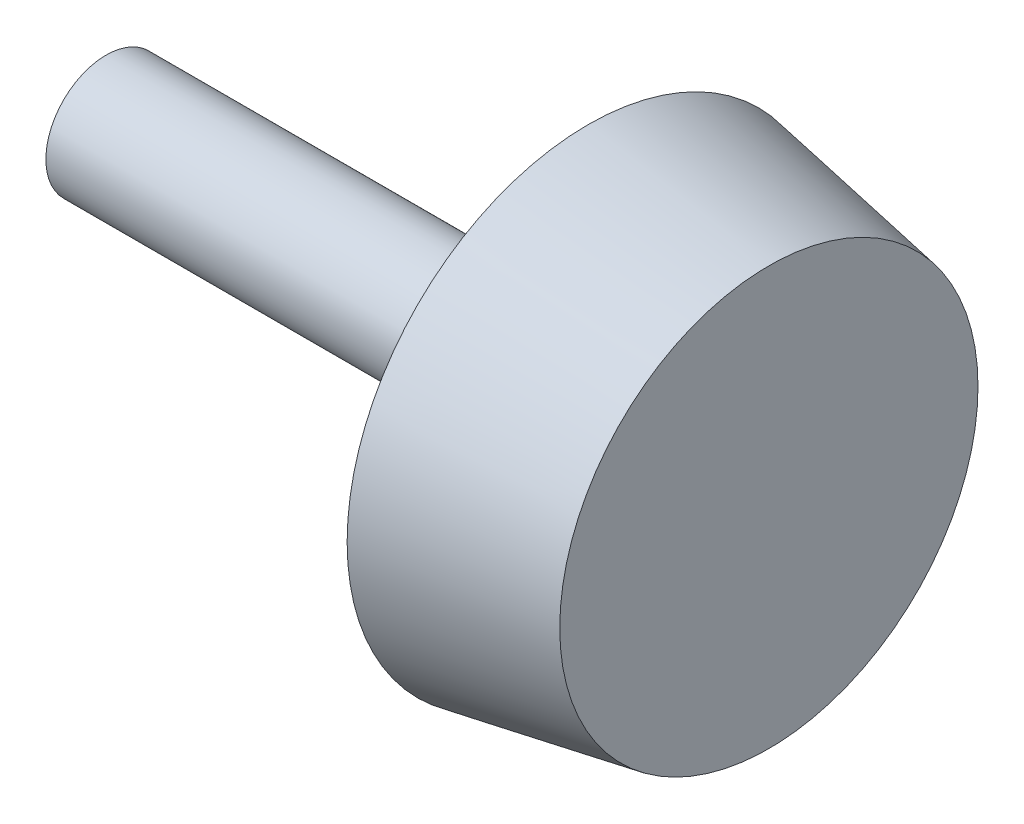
from build123d import *

# Parameters (mm, degrees)
SKETCH1_R           = 3.175
BOSS_EXTRUDE1_DEPTH = 25.4
SKETCH2_R           = 12.7
BOSS_EXTRUDE2_DEPTH = 9.525
BOSS_EXTRUDE2_TAPER = 10


with BuildPart() as part:
    # Sketch1 → Boss-Extrude1 (new body)
    with BuildSketch(Plane(origin=(0, 0, 0), x_dir=(0, 0, -1), z_dir=(1, 0, 0))):
        Circle(SKETCH1_R)
    extrude(amount=BOSS_EXTRUDE1_DEPTH)

    # Sketch2 → Boss-Extrude2 (add)
    with BuildSketch(Plane(origin=(25.4, 0, 0), x_dir=(0, 0, -1), z_dir=(1, 0, 0))):
        Circle(SKETCH2_R)
    extrude(amount=BOSS_EXTRUDE2_DEPTH, taper=BOSS_EXTRUDE2_TAPER)


solid = part.part
